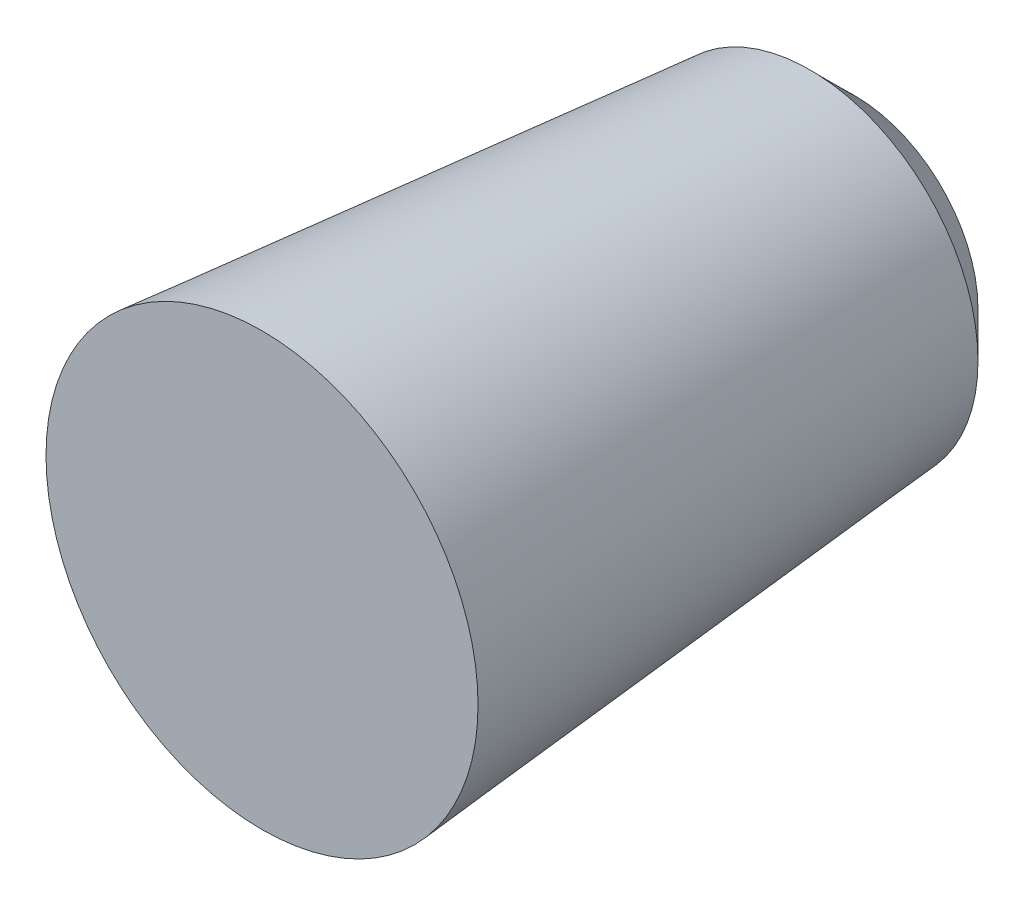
from build123d import *

# Parameters (mm, degrees)
ESQUISSE1_R        = 24
BOSS_EXTRU_1_DEPTH = 86.681363
BOSS_EXTRU_1_DRAFT = -5
CHANFREIN1_SIZE    = 6
CHANFREIN1_SIZE2   = 6.600377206


with BuildPart() as part:
    # Esquisse1 → Boss.-Extru.1 (with draft: the straight prism first)
    with BuildSketch(Plane.XY):
        with Locations((32.060452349, -76.176947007)):
            Circle(ESQUISSE1_R)
    extrude(amount=BOSS_EXTRU_1_DEPTH)
    # Boss.-Extru.1: the draft: its side faces are tilted about the plane it starts from
    boss_extru_1_sides = [part.faces().sort_by_distance(p)[0] for p in [
        (8.060452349, -76.176947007, 43.3406815),
    ]]
    draft(boss_extru_1_sides, Plane.XY, BOSS_EXTRU_1_DRAFT)

    # Chanfrein1
    chanfrein1_edges = [part.edges().sort_by_distance(p)[0] for p in [
        (8.060452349, -76.176947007, 0),
    ]]
    chanfrein1_side = [part.faces().sort_by_distance(p)[0] for p in [
        (32.060452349, -76.176947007, 0),
    ]]
    chamfer(chanfrein1_edges, length=CHANFREIN1_SIZE, length2=CHANFREIN1_SIZE2, reference=chanfrein1_side[0])


solid = part.part
